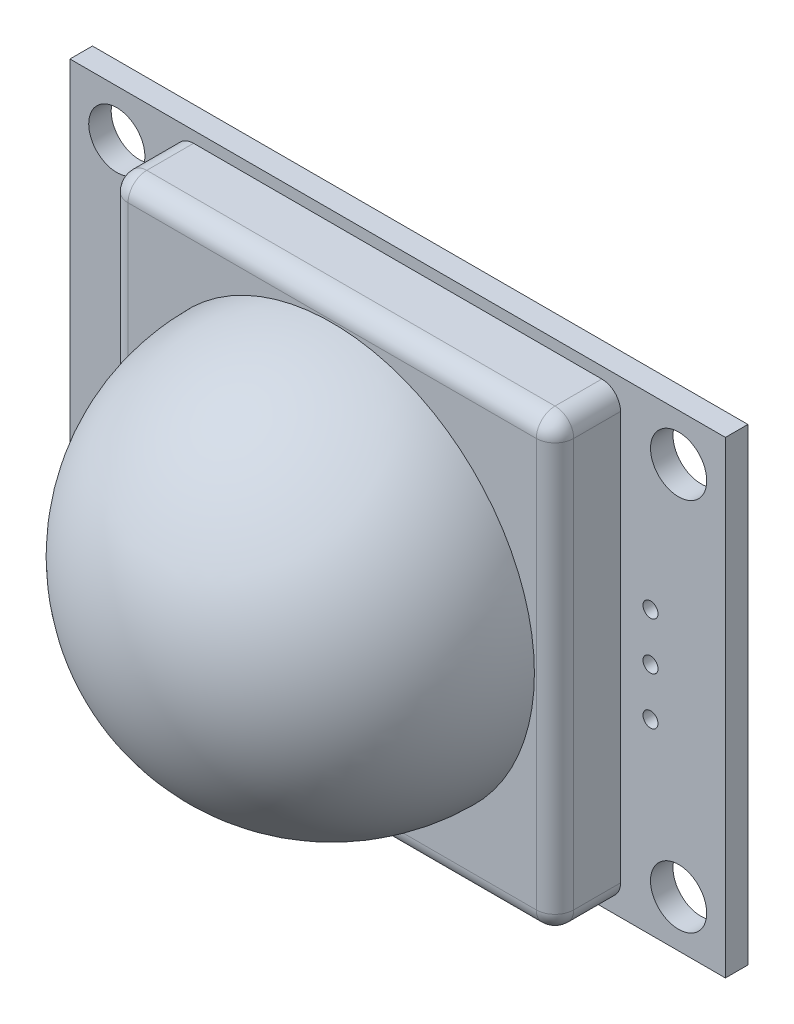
ISO-10303-21;
HEADER;
FILE_DESCRIPTION(('STEP AP214'),'2;1');
FILE_NAME('part.step','',(''),(''),'','','');
FILE_SCHEMA(('AUTOMOTIVE_DESIGN { 1 0 10303 214 1 1 1 1 }'));
ENDSEC;
DATA;
#1=APPLICATION_CONTEXT('core data for automotive mechanical design processes');
#2=APPLICATION_PROTOCOL_DEFINITION('international standard','automotive_design',2000,#1);
#3=PRODUCT_CONTEXT('',#1,'mechanical');
#4=PRODUCT('Part','Part','',(#3));
#5=PRODUCT_RELATED_PRODUCT_CATEGORY('part','',(#4));
#6=PRODUCT_DEFINITION_FORMATION('','',#4);
#7=PRODUCT_DEFINITION_CONTEXT('part definition',#1,'design');
#8=PRODUCT_DEFINITION('design','',#6,#7);
#9=PRODUCT_DEFINITION_SHAPE('','',#8);
#10=(LENGTH_UNIT() NAMED_UNIT(*) SI_UNIT(.MILLI.,.METRE.));
#11=(NAMED_UNIT(*) PLANE_ANGLE_UNIT() SI_UNIT($,.RADIAN.));
#12=(NAMED_UNIT(*) SI_UNIT($,.STERADIAN.) SOLID_ANGLE_UNIT());
#13=UNCERTAINTY_MEASURE_WITH_UNIT(LENGTH_MEASURE(1.E-05),#10,'distance_accuracy_value','');
#14=(GEOMETRIC_REPRESENTATION_CONTEXT(3) GLOBAL_UNCERTAINTY_ASSIGNED_CONTEXT((#13)) GLOBAL_UNIT_ASSIGNED_CONTEXT((#10,
#11,#12)) REPRESENTATION_CONTEXT('',''));
#15=CARTESIAN_POINT('',(0.,0.,0.));
#16=DIRECTION('',(0.,0.,1.));
#17=DIRECTION('',(1.,0.,0.));
#18=AXIS2_PLACEMENT_3D('',#15,#16,#17);
#19=CARTESIAN_POINT('',(28.4,23.4,4.7));
#20=DIRECTION('',(0.,0.,-1.));
#21=DIRECTION('',(-1.,0.,0.));
#22=AXIS2_PLACEMENT_3D('',#19,#20,#21);
#23=PLANE('',#22);
#24=DIRECTION('',(-1.,0.,0.));
#25=VECTOR('',#24,1.);
#26=CARTESIAN_POINT('',(28.4,23.4,4.7));
#27=LINE('',#26,#25);
#28=CARTESIAN_POINT('',(28.4,23.4,4.7));
#29=VERTEX_POINT('',#28);
#30=CARTESIAN_POINT('',(6.6,23.4,4.7));
#31=VERTEX_POINT('',#30);
#32=EDGE_CURVE('E256',#29,#31,#27,.T.);
#33=ORIENTED_EDGE('',*,*,#32,.T.);
#34=DIRECTION('',(0.,-1.,0.));
#35=VECTOR('',#34,1.);
#36=CARTESIAN_POINT('',(6.6,23.4,4.7));
#37=LINE('',#36,#35);
#38=CARTESIAN_POINT('',(6.6,1.6,4.7));
#39=VERTEX_POINT('',#38);
#40=EDGE_CURVE('E258',#31,#39,#37,.T.);
#41=ORIENTED_EDGE('',*,*,#40,.T.);
#42=DIRECTION('',(1.,0.,0.));
#43=VECTOR('',#42,1.);
#44=CARTESIAN_POINT('',(28.4,1.6,4.7));
#45=LINE('',#44,#43);
#46=CARTESIAN_POINT('',(28.4,1.6,4.7));
#47=VERTEX_POINT('',#46);
#48=EDGE_CURVE('E252',#39,#47,#45,.T.);
#49=ORIENTED_EDGE('',*,*,#48,.T.);
#50=DIRECTION('',(0.,1.,0.));
#51=VECTOR('',#50,1.);
#52=CARTESIAN_POINT('',(28.4,23.4,4.7));
#53=LINE('',#52,#51);
#54=EDGE_CURVE('E254',#47,#29,#53,.T.);
#55=ORIENTED_EDGE('',*,*,#54,.T.);
#56=EDGE_LOOP('',(#33,#41,#49,#55));
#57=FACE_BOUND('',#56,.T.);
#58=CARTESIAN_POINT('',(17.5,12.5,4.7));
#59=DIRECTION('',(0.,0.,-1.));
#60=DIRECTION('',(-1.,0.,0.));
#61=AXIS2_PLACEMENT_3D('',#58,#59,#60);
#62=CIRCLE('',#61,10.8001);
#63=CARTESIAN_POINT('',(6.6999,12.5,4.7));
#64=VERTEX_POINT('',#63);
#65=EDGE_CURVE('E11',#64,#64,#62,.F.);
#66=ORIENTED_EDGE('',*,*,#65,.F.);
#67=EDGE_LOOP('',(#66));
#68=FACE_BOUND('',#67,.T.);
#69=ADVANCED_FACE('F32',(#57,#68),#23,.F.);
#70=CARTESIAN_POINT('',(0.,25.,1.2));
#71=DIRECTION('',(0.,0.,-1.));
#72=DIRECTION('',(-1.,0.,0.));
#73=AXIS2_PLACEMENT_3D('',#70,#71,#72);
#74=PLANE('',#73);
#75=CARTESIAN_POINT('',(31.,15.04,1.2));
#76=DIRECTION('',(0.,0.,1.));
#77=DIRECTION('',(1.,0.,0.));
#78=AXIS2_PLACEMENT_3D('',#75,#76,#77);
#79=CIRCLE('',#78,0.400000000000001);
#80=CARTESIAN_POINT('',(31.4,15.04,1.2));
#81=VERTEX_POINT('',#80);
#82=EDGE_CURVE('E180',#81,#81,#79,.T.);
#83=ORIENTED_EDGE('',*,*,#82,.F.);
#84=EDGE_LOOP('',(#83));
#85=FACE_BOUND('',#84,.T.);
#86=CARTESIAN_POINT('',(31.,12.5,1.2));
#87=DIRECTION('',(0.,0.,1.));
#88=DIRECTION('',(1.,0.,0.));
#89=AXIS2_PLACEMENT_3D('',#86,#87,#88);
#90=CIRCLE('',#89,0.399999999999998);
#91=CARTESIAN_POINT('',(31.4,12.5,1.2));
#92=VERTEX_POINT('',#91);
#93=EDGE_CURVE('E192',#92,#92,#90,.T.);
#94=ORIENTED_EDGE('',*,*,#93,.F.);
#95=EDGE_LOOP('',(#94));
#96=FACE_BOUND('',#95,.T.);
#97=CARTESIAN_POINT('',(32.5,22.5,1.2));
#98=DIRECTION('',(0.,0.,1.));
#99=DIRECTION('',(1.,0.,0.));
#100=AXIS2_PLACEMENT_3D('',#97,#98,#99);
#101=CIRCLE('',#100,1.5);
#102=CARTESIAN_POINT('',(34.,22.5,1.2));
#103=VERTEX_POINT('',#102);
#104=EDGE_CURVE('E204',#103,#103,#101,.T.);
#105=ORIENTED_EDGE('',*,*,#104,.F.);
#106=EDGE_LOOP('',(#105));
#107=FACE_BOUND('',#106,.T.);
#108=CARTESIAN_POINT('',(2.5,2.5,1.2));
#109=DIRECTION('',(0.,0.,1.));
#110=DIRECTION('',(1.,0.,0.));
#111=AXIS2_PLACEMENT_3D('',#108,#109,#110);
#112=CIRCLE('',#111,1.5);
#113=CARTESIAN_POINT('',(4.,2.5,1.2));
#114=VERTEX_POINT('',#113);
#115=EDGE_CURVE('E216',#114,#114,#112,.T.);
#116=ORIENTED_EDGE('',*,*,#115,.F.);
#117=EDGE_LOOP('',(#116));
#118=FACE_BOUND('',#117,.T.);
#119=DIRECTION('',(0.,-1.,0.));
#120=VECTOR('',#119,1.);
#121=CARTESIAN_POINT('',(0.,0.,1.2));
#122=LINE('',#121,#120);
#123=CARTESIAN_POINT('',(0.,25.,1.2));
#124=VERTEX_POINT('',#123);
#125=CARTESIAN_POINT('',(0.,0.,1.2));
#126=VERTEX_POINT('',#125);
#127=EDGE_CURVE('E228',#124,#126,#122,.T.);
#128=ORIENTED_EDGE('',*,*,#127,.T.);
#129=DIRECTION('',(1.,0.,0.));
#130=VECTOR('',#129,1.);
#131=CARTESIAN_POINT('',(0.,0.,1.2));
#132=LINE('',#131,#130);
#133=CARTESIAN_POINT('',(35.,0.,1.2));
#134=VERTEX_POINT('',#133);
#135=EDGE_CURVE('E231',#126,#134,#132,.T.);
#136=ORIENTED_EDGE('',*,*,#135,.T.);
#137=DIRECTION('',(0.,1.,0.));
#138=VECTOR('',#137,1.);
#139=CARTESIAN_POINT('',(35.,0.,1.2));
#140=LINE('',#139,#138);
#141=CARTESIAN_POINT('',(35.,25.,1.2));
#142=VERTEX_POINT('',#141);
#143=EDGE_CURVE('E233',#134,#142,#140,.T.);
#144=ORIENTED_EDGE('',*,*,#143,.T.);
#145=DIRECTION('',(-1.,0.,0.));
#146=VECTOR('',#145,1.);
#147=CARTESIAN_POINT('',(0.,25.,1.2));
#148=LINE('',#147,#146);
#149=EDGE_CURVE('E235',#142,#124,#148,.T.);
#150=ORIENTED_EDGE('',*,*,#149,.T.);
#151=EDGE_LOOP('',(#128,#136,#144,#150));
#152=FACE_BOUND('',#151,.T.);
#153=CARTESIAN_POINT('',(32.5,2.50000000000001,1.2));
#154=DIRECTION('',(0.,0.,1.));
#155=DIRECTION('',(-1.,0.,0.));
#156=AXIS2_PLACEMENT_3D('',#153,#154,#155);
#157=CIRCLE('',#156,1.5);
#158=CARTESIAN_POINT('',(31.,2.50000000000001,1.2));
#159=VERTEX_POINT('',#158);
#160=EDGE_CURVE('E210',#159,#159,#157,.T.);
#161=ORIENTED_EDGE('',*,*,#160,.F.);
#162=EDGE_LOOP('',(#161));
#163=FACE_BOUND('',#162,.T.);
#164=CARTESIAN_POINT('',(2.5,22.5,1.2));
#165=DIRECTION('',(0.,0.,1.));
#166=DIRECTION('',(-1.,0.,0.));
#167=AXIS2_PLACEMENT_3D('',#164,#165,#166);
#168=CIRCLE('',#167,1.5);
#169=CARTESIAN_POINT('',(1.,22.5,1.2));
#170=VERTEX_POINT('',#169);
#171=EDGE_CURVE('E198',#170,#170,#168,.T.);
#172=ORIENTED_EDGE('',*,*,#171,.F.);
#173=EDGE_LOOP('',(#172));
#174=FACE_BOUND('',#173,.T.);
#175=CARTESIAN_POINT('',(31.,9.96,1.2));
#176=DIRECTION('',(0.,0.,1.));
#177=DIRECTION('',(-1.,0.,0.));
#178=AXIS2_PLACEMENT_3D('',#175,#176,#177);
#179=CIRCLE('',#178,0.400000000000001);
#180=CARTESIAN_POINT('',(30.6,9.96,1.2));
#181=VERTEX_POINT('',#180);
#182=EDGE_CURVE('E186',#181,#181,#179,.T.);
#183=ORIENTED_EDGE('',*,*,#182,.F.);
#184=EDGE_LOOP('',(#183));
#185=FACE_BOUND('',#184,.T.);
#186=CARTESIAN_POINT('',(28.4,23.4,1.2));
#187=DIRECTION('',(0.,0.,1.));
#188=DIRECTION('',(-1.,0.,0.));
#189=AXIS2_PLACEMENT_3D('',#186,#187,#188);
#190=CIRCLE('',#189,1.);
#191=CARTESIAN_POINT('',(29.4,23.4,1.2));
#192=VERTEX_POINT('',#191);
#193=CARTESIAN_POINT('',(28.4,24.4,1.2));
#194=VERTEX_POINT('',#193);
#195=EDGE_CURVE('E138',#192,#194,#190,.T.);
#196=ORIENTED_EDGE('',*,*,#195,.F.);
#197=DIRECTION('',(0.,1.,0.));
#198=VECTOR('',#197,1.);
#199=CARTESIAN_POINT('',(29.4,23.4,1.2));
#200=LINE('',#199,#198);
#201=CARTESIAN_POINT('',(29.4,1.60000000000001,1.2));
#202=VERTEX_POINT('',#201);
#203=EDGE_CURVE('E144',#202,#192,#200,.T.);
#204=ORIENTED_EDGE('',*,*,#203,.F.);
#205=CARTESIAN_POINT('',(28.4,1.6,1.2));
#206=DIRECTION('',(0.,0.,1.));
#207=DIRECTION('',(1.,0.,0.));
#208=AXIS2_PLACEMENT_3D('',#205,#206,#207);
#209=CIRCLE('',#208,1.);
#210=CARTESIAN_POINT('',(28.4,0.600000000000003,1.2));
#211=VERTEX_POINT('',#210);
#212=EDGE_CURVE('E158',#211,#202,#209,.T.);
#213=ORIENTED_EDGE('',*,*,#212,.F.);
#214=DIRECTION('',(1.,0.,0.));
#215=VECTOR('',#214,1.);
#216=CARTESIAN_POINT('',(6.60000000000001,0.599999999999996,1.2));
#217=LINE('',#216,#215);
#218=CARTESIAN_POINT('',(6.60000000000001,0.599999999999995,1.2));
#219=VERTEX_POINT('',#218);
#220=EDGE_CURVE('E160',#219,#211,#217,.T.);
#221=ORIENTED_EDGE('',*,*,#220,.F.);
#222=CARTESIAN_POINT('',(6.6,1.6,1.2));
#223=DIRECTION('',(0.,0.,1.));
#224=DIRECTION('',(1.,0.,0.));
#225=AXIS2_PLACEMENT_3D('',#222,#223,#224);
#226=CIRCLE('',#225,1.);
#227=CARTESIAN_POINT('',(5.6,1.6,1.2));
#228=VERTEX_POINT('',#227);
#229=EDGE_CURVE('E285',#228,#219,#226,.T.);
#230=ORIENTED_EDGE('',*,*,#229,.F.);
#231=DIRECTION('',(0.,-1.,0.));
#232=VECTOR('',#231,1.);
#233=CARTESIAN_POINT('',(5.6,23.4,1.2));
#234=LINE('',#233,#232);
#235=CARTESIAN_POINT('',(5.6,23.4,1.2));
#236=VERTEX_POINT('',#235);
#237=EDGE_CURVE('E320',#236,#228,#234,.T.);
#238=ORIENTED_EDGE('',*,*,#237,.F.);
#239=CARTESIAN_POINT('',(6.6,23.4,1.2));
#240=DIRECTION('',(0.,0.,1.));
#241=DIRECTION('',(1.,0.,0.));
#242=AXIS2_PLACEMENT_3D('',#239,#240,#241);
#243=CIRCLE('',#242,1.);
#244=CARTESIAN_POINT('',(6.6,24.4,1.2));
#245=VERTEX_POINT('',#244);
#246=EDGE_CURVE('E317',#245,#236,#243,.T.);
#247=ORIENTED_EDGE('',*,*,#246,.F.);
#248=DIRECTION('',(-1.,0.,0.));
#249=VECTOR('',#248,1.);
#250=CARTESIAN_POINT('',(6.6,24.4,1.2));
#251=LINE('',#250,#249);
#252=EDGE_CURVE('E154',#194,#245,#251,.T.);
#253=ORIENTED_EDGE('',*,*,#252,.F.);
#254=EDGE_LOOP('',(#196,#204,#213,#221,#230,#238,#247,#253));
#255=FACE_BOUND('',#254,.T.);
#256=ADVANCED_FACE('F149',(#85,#96,#107,#118,#152,#163,#174,#185,#255),#74,.F.);
#257=CARTESIAN_POINT('',(0.,25.,0.));
#258=DIRECTION('',(0.,0.,-1.));
#259=DIRECTION('',(-1.,0.,0.));
#260=AXIS2_PLACEMENT_3D('',#257,#258,#259);
#261=PLANE('',#260);
#262=CARTESIAN_POINT('',(31.,9.96,0.));
#263=DIRECTION('',(0.,0.,1.));
#264=DIRECTION('',(-1.,0.,0.));
#265=AXIS2_PLACEMENT_3D('',#262,#263,#264);
#266=CIRCLE('',#265,0.400000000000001);
#267=CARTESIAN_POINT('',(30.6,9.96,0.));
#268=VERTEX_POINT('',#267);
#269=EDGE_CURVE('E183',#268,#268,#266,.T.);
#270=ORIENTED_EDGE('',*,*,#269,.T.);
#271=EDGE_LOOP('',(#270));
#272=FACE_BOUND('',#271,.T.);
#273=CARTESIAN_POINT('',(2.5,22.5,0.));
#274=DIRECTION('',(0.,0.,1.));
#275=DIRECTION('',(-1.,0.,0.));
#276=AXIS2_PLACEMENT_3D('',#273,#274,#275);
#277=CIRCLE('',#276,1.5);
#278=CARTESIAN_POINT('',(1.,22.5,0.));
#279=VERTEX_POINT('',#278);
#280=EDGE_CURVE('E195',#279,#279,#277,.T.);
#281=ORIENTED_EDGE('',*,*,#280,.T.);
#282=EDGE_LOOP('',(#281));
#283=FACE_BOUND('',#282,.T.);
#284=CARTESIAN_POINT('',(32.5,2.50000000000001,0.));
#285=DIRECTION('',(0.,0.,1.));
#286=DIRECTION('',(-1.,0.,0.));
#287=AXIS2_PLACEMENT_3D('',#284,#285,#286);
#288=CIRCLE('',#287,1.5);
#289=CARTESIAN_POINT('',(31.,2.50000000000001,0.));
#290=VERTEX_POINT('',#289);
#291=EDGE_CURVE('E207',#290,#290,#288,.T.);
#292=ORIENTED_EDGE('',*,*,#291,.T.);
#293=EDGE_LOOP('',(#292));
#294=FACE_BOUND('',#293,.T.);
#295=DIRECTION('',(0.,-1.,0.));
#296=VECTOR('',#295,1.);
#297=CARTESIAN_POINT('',(0.,0.,0.));
#298=LINE('',#297,#296);
#299=CARTESIAN_POINT('',(0.,25.,0.));
#300=VERTEX_POINT('',#299);
#301=CARTESIAN_POINT('',(0.,0.,0.));
#302=VERTEX_POINT('',#301);
#303=EDGE_CURVE('E219',#300,#302,#298,.T.);
#304=ORIENTED_EDGE('',*,*,#303,.F.);
#305=DIRECTION('',(-1.,0.,0.));
#306=VECTOR('',#305,1.);
#307=CARTESIAN_POINT('',(0.,25.,0.));
#308=LINE('',#307,#306);
#309=CARTESIAN_POINT('',(35.,25.,0.));
#310=VERTEX_POINT('',#309);
#311=EDGE_CURVE('E226',#310,#300,#308,.T.);
#312=ORIENTED_EDGE('',*,*,#311,.F.);
#313=DIRECTION('',(0.,1.,0.));
#314=VECTOR('',#313,1.);
#315=CARTESIAN_POINT('',(35.,0.,0.));
#316=LINE('',#315,#314);
#317=CARTESIAN_POINT('',(35.,0.,0.));
#318=VERTEX_POINT('',#317);
#319=EDGE_CURVE('E224',#318,#310,#316,.T.);
#320=ORIENTED_EDGE('',*,*,#319,.F.);
#321=DIRECTION('',(1.,0.,0.));
#322=VECTOR('',#321,1.);
#323=CARTESIAN_POINT('',(0.,0.,0.));
#324=LINE('',#323,#322);
#325=EDGE_CURVE('E222',#302,#318,#324,.T.);
#326=ORIENTED_EDGE('',*,*,#325,.F.);
#327=EDGE_LOOP('',(#304,#312,#320,#326));
#328=FACE_BOUND('',#327,.T.);
#329=CARTESIAN_POINT('',(2.5,2.5,0.));
#330=DIRECTION('',(0.,0.,1.));
#331=DIRECTION('',(1.,0.,0.));
#332=AXIS2_PLACEMENT_3D('',#329,#330,#331);
#333=CIRCLE('',#332,1.5);
#334=CARTESIAN_POINT('',(4.,2.5,0.));
#335=VERTEX_POINT('',#334);
#336=EDGE_CURVE('E213',#335,#335,#333,.T.);
#337=ORIENTED_EDGE('',*,*,#336,.T.);
#338=EDGE_LOOP('',(#337));
#339=FACE_BOUND('',#338,.T.);
#340=CARTESIAN_POINT('',(32.5,22.5,0.));
#341=DIRECTION('',(0.,0.,1.));
#342=DIRECTION('',(1.,0.,0.));
#343=AXIS2_PLACEMENT_3D('',#340,#341,#342);
#344=CIRCLE('',#343,1.5);
#345=CARTESIAN_POINT('',(34.,22.5,0.));
#346=VERTEX_POINT('',#345);
#347=EDGE_CURVE('E201',#346,#346,#344,.T.);
#348=ORIENTED_EDGE('',*,*,#347,.T.);
#349=EDGE_LOOP('',(#348));
#350=FACE_BOUND('',#349,.T.);
#351=CARTESIAN_POINT('',(31.,12.5,0.));
#352=DIRECTION('',(0.,0.,1.));
#353=DIRECTION('',(1.,0.,0.));
#354=AXIS2_PLACEMENT_3D('',#351,#352,#353);
#355=CIRCLE('',#354,0.399999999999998);
#356=CARTESIAN_POINT('',(31.4,12.5,0.));
#357=VERTEX_POINT('',#356);
#358=EDGE_CURVE('E189',#357,#357,#355,.T.);
#359=ORIENTED_EDGE('',*,*,#358,.T.);
#360=EDGE_LOOP('',(#359));
#361=FACE_BOUND('',#360,.T.);
#362=CARTESIAN_POINT('',(31.,15.04,0.));
#363=DIRECTION('',(0.,0.,1.));
#364=DIRECTION('',(1.,0.,0.));
#365=AXIS2_PLACEMENT_3D('',#362,#363,#364);
#366=CIRCLE('',#365,0.400000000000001);
#367=CARTESIAN_POINT('',(31.4,15.04,0.));
#368=VERTEX_POINT('',#367);
#369=EDGE_CURVE('E177',#368,#368,#366,.T.);
#370=ORIENTED_EDGE('',*,*,#369,.T.);
#371=EDGE_LOOP('',(#370));
#372=FACE_BOUND('',#371,.T.);
#373=ADVANCED_FACE('F352',(#272,#283,#294,#328,#339,#350,#361,#372),#261,.T.);
#374=CARTESIAN_POINT('',(0.,0.,1.2));
#375=DIRECTION('',(1.,0.,0.));
#376=DIRECTION('',(0.,0.,-1.));
#377=AXIS2_PLACEMENT_3D('',#374,#375,#376);
#378=PLANE('',#377);
#379=ORIENTED_EDGE('',*,*,#303,.T.);
#380=DIRECTION('',(0.,0.,-1.));
#381=VECTOR('',#380,1.);
#382=CARTESIAN_POINT('',(0.,0.,1.2));
#383=LINE('',#382,#381);
#384=EDGE_CURVE('E246',#126,#302,#383,.T.);
#385=ORIENTED_EDGE('',*,*,#384,.F.);
#386=ORIENTED_EDGE('',*,*,#127,.F.);
#387=DIRECTION('',(0.,0.,-1.));
#388=VECTOR('',#387,1.);
#389=CARTESIAN_POINT('',(0.,25.,1.2));
#390=LINE('',#389,#388);
#391=EDGE_CURVE('E237',#124,#300,#390,.T.);
#392=ORIENTED_EDGE('',*,*,#391,.T.);
#393=EDGE_LOOP('',(#379,#385,#386,#392));
#394=FACE_BOUND('',#393,.T.);
#395=ADVANCED_FACE('F34',(#394),#378,.F.);
#396=CARTESIAN_POINT('',(0.,0.,1.2));
#397=DIRECTION('',(0.,1.,0.));
#398=DIRECTION('',(0.,0.,1.));
#399=AXIS2_PLACEMENT_3D('',#396,#397,#398);
#400=PLANE('',#399);
#401=ORIENTED_EDGE('',*,*,#325,.T.);
#402=DIRECTION('',(0.,0.,-1.));
#403=VECTOR('',#402,1.);
#404=CARTESIAN_POINT('',(35.,0.,1.2));
#405=LINE('',#404,#403);
#406=EDGE_CURVE('E243',#134,#318,#405,.T.);
#407=ORIENTED_EDGE('',*,*,#406,.F.);
#408=ORIENTED_EDGE('',*,*,#135,.F.);
#409=ORIENTED_EDGE('',*,*,#384,.T.);
#410=EDGE_LOOP('',(#401,#407,#408,#409));
#411=FACE_BOUND('',#410,.T.);
#412=ADVANCED_FACE('F552',(#411),#400,.F.);
#413=CARTESIAN_POINT('',(35.,0.,1.2));
#414=DIRECTION('',(-1.,0.,0.));
#415=DIRECTION('',(0.,0.,1.));
#416=AXIS2_PLACEMENT_3D('',#413,#414,#415);
#417=PLANE('',#416);
#418=ORIENTED_EDGE('',*,*,#319,.T.);
#419=DIRECTION('',(0.,0.,-1.));
#420=VECTOR('',#419,1.);
#421=CARTESIAN_POINT('',(35.,25.,1.2));
#422=LINE('',#421,#420);
#423=EDGE_CURVE('E240',#142,#310,#422,.T.);
#424=ORIENTED_EDGE('',*,*,#423,.F.);
#425=ORIENTED_EDGE('',*,*,#143,.F.);
#426=ORIENTED_EDGE('',*,*,#406,.T.);
#427=EDGE_LOOP('',(#418,#424,#425,#426));
#428=FACE_BOUND('',#427,.T.);
#429=ADVANCED_FACE('F544',(#428),#417,.F.);
#430=CARTESIAN_POINT('',(0.,25.,1.2));
#431=DIRECTION('',(0.,-1.,0.));
#432=DIRECTION('',(0.,0.,-1.));
#433=AXIS2_PLACEMENT_3D('',#430,#431,#432);
#434=PLANE('',#433);
#435=ORIENTED_EDGE('',*,*,#311,.T.);
#436=ORIENTED_EDGE('',*,*,#391,.F.);
#437=ORIENTED_EDGE('',*,*,#149,.F.);
#438=ORIENTED_EDGE('',*,*,#423,.T.);
#439=EDGE_LOOP('',(#435,#436,#437,#438));
#440=FACE_BOUND('',#439,.T.);
#441=ADVANCED_FACE('F536',(#440),#434,.F.);
#442=CARTESIAN_POINT('',(2.5,2.5,1.2));
#443=DIRECTION('',(0.,0.,-1.));
#444=DIRECTION('',(-1.,0.,0.));
#445=AXIS2_PLACEMENT_3D('',#442,#443,#444);
#446=CYLINDRICAL_SURFACE('',#445,1.5);
#447=ORIENTED_EDGE('',*,*,#115,.T.);
#448=EDGE_LOOP('',(#447));
#449=FACE_BOUND('',#448,.T.);
#450=ORIENTED_EDGE('',*,*,#336,.F.);
#451=EDGE_LOOP('',(#450));
#452=FACE_BOUND('',#451,.T.);
#453=ADVANCED_FACE('F528',(#449,#452),#446,.F.);
#454=CARTESIAN_POINT('',(32.5,2.50000000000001,1.2));
#455=DIRECTION('',(0.,0.,-1.));
#456=DIRECTION('',(-1.,0.,0.));
#457=AXIS2_PLACEMENT_3D('',#454,#455,#456);
#458=CYLINDRICAL_SURFACE('',#457,1.5);
#459=ORIENTED_EDGE('',*,*,#160,.T.);
#460=EDGE_LOOP('',(#459));
#461=FACE_BOUND('',#460,.T.);
#462=ORIENTED_EDGE('',*,*,#291,.F.);
#463=EDGE_LOOP('',(#462));
#464=FACE_BOUND('',#463,.T.);
#465=ADVANCED_FACE('F520',(#461,#464),#458,.F.);
#466=CARTESIAN_POINT('',(32.5,22.5,1.2));
#467=DIRECTION('',(0.,0.,-1.));
#468=DIRECTION('',(-1.,0.,0.));
#469=AXIS2_PLACEMENT_3D('',#466,#467,#468);
#470=CYLINDRICAL_SURFACE('',#469,1.5);
#471=ORIENTED_EDGE('',*,*,#104,.T.);
#472=EDGE_LOOP('',(#471));
#473=FACE_BOUND('',#472,.T.);
#474=ORIENTED_EDGE('',*,*,#347,.F.);
#475=EDGE_LOOP('',(#474));
#476=FACE_BOUND('',#475,.T.);
#477=ADVANCED_FACE('F512',(#473,#476),#470,.F.);
#478=CARTESIAN_POINT('',(2.5,22.5,1.2));
#479=DIRECTION('',(0.,0.,-1.));
#480=DIRECTION('',(-1.,0.,0.));
#481=AXIS2_PLACEMENT_3D('',#478,#479,#480);
#482=CYLINDRICAL_SURFACE('',#481,1.5);
#483=ORIENTED_EDGE('',*,*,#171,.T.);
#484=EDGE_LOOP('',(#483));
#485=FACE_BOUND('',#484,.T.);
#486=ORIENTED_EDGE('',*,*,#280,.F.);
#487=EDGE_LOOP('',(#486));
#488=FACE_BOUND('',#487,.T.);
#489=ADVANCED_FACE('F504',(#485,#488),#482,.F.);
#490=CARTESIAN_POINT('',(31.,12.5,1.2));
#491=DIRECTION('',(0.,0.,-1.));
#492=DIRECTION('',(-1.,0.,0.));
#493=AXIS2_PLACEMENT_3D('',#490,#491,#492);
#494=CYLINDRICAL_SURFACE('',#493,0.399999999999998);
#495=ORIENTED_EDGE('',*,*,#93,.T.);
#496=EDGE_LOOP('',(#495));
#497=FACE_BOUND('',#496,.T.);
#498=ORIENTED_EDGE('',*,*,#358,.F.);
#499=EDGE_LOOP('',(#498));
#500=FACE_BOUND('',#499,.T.);
#501=ADVANCED_FACE('F496',(#497,#500),#494,.F.);
#502=CARTESIAN_POINT('',(31.,9.96,1.2));
#503=DIRECTION('',(0.,0.,-1.));
#504=DIRECTION('',(-1.,0.,0.));
#505=AXIS2_PLACEMENT_3D('',#502,#503,#504);
#506=CYLINDRICAL_SURFACE('',#505,0.400000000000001);
#507=ORIENTED_EDGE('',*,*,#182,.T.);
#508=EDGE_LOOP('',(#507));
#509=FACE_BOUND('',#508,.T.);
#510=ORIENTED_EDGE('',*,*,#269,.F.);
#511=EDGE_LOOP('',(#510));
#512=FACE_BOUND('',#511,.T.);
#513=ADVANCED_FACE('F488',(#509,#512),#506,.F.);
#514=CARTESIAN_POINT('',(31.,15.04,1.2));
#515=DIRECTION('',(0.,0.,-1.));
#516=DIRECTION('',(-1.,0.,0.));
#517=AXIS2_PLACEMENT_3D('',#514,#515,#516);
#518=CYLINDRICAL_SURFACE('',#517,0.400000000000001);
#519=ORIENTED_EDGE('',*,*,#82,.T.);
#520=EDGE_LOOP('',(#519));
#521=FACE_BOUND('',#520,.T.);
#522=ORIENTED_EDGE('',*,*,#369,.F.);
#523=EDGE_LOOP('',(#522));
#524=FACE_BOUND('',#523,.T.);
#525=ADVANCED_FACE('F477',(#521,#524),#518,.F.);
#526=CARTESIAN_POINT('',(28.4,23.4,4.7));
#527=DIRECTION('',(0.,0.,-1.));
#528=DIRECTION('',(-1.,0.,0.));
#529=AXIS2_PLACEMENT_3D('',#526,#527,#528);
#530=CYLINDRICAL_SURFACE('',#529,1.);
#531=DIRECTION('',(0.,0.,-1.));
#532=VECTOR('',#531,1.);
#533=CARTESIAN_POINT('',(28.4,24.4,4.7));
#534=LINE('',#533,#532);
#535=CARTESIAN_POINT('',(28.4,24.4,3.7));
#536=VERTEX_POINT('',#535);
#537=EDGE_CURVE('E175',#536,#194,#534,.T.);
#538=ORIENTED_EDGE('',*,*,#537,.F.);
#539=CARTESIAN_POINT('',(28.4,23.4,3.7));
#540=DIRECTION('',(0.,0.,-1.));
#541=DIRECTION('',(-1.,0.,0.));
#542=AXIS2_PLACEMENT_3D('',#539,#540,#541);
#543=CIRCLE('',#542,1.);
#544=CARTESIAN_POINT('',(29.4,23.4,3.7));
#545=VERTEX_POINT('',#544);
#546=EDGE_CURVE('E140',#536,#545,#543,.T.);
#547=ORIENTED_EDGE('',*,*,#546,.T.);
#548=DIRECTION('',(0.,0.,-1.));
#549=VECTOR('',#548,1.);
#550=CARTESIAN_POINT('',(29.4,23.4,4.7));
#551=LINE('',#550,#549);
#552=EDGE_CURVE('E134',#545,#192,#551,.T.);
#553=ORIENTED_EDGE('',*,*,#552,.T.);
#554=ORIENTED_EDGE('',*,*,#195,.T.);
#555=EDGE_LOOP('',(#538,#547,#553,#554));
#556=FACE_BOUND('',#555,.T.);
#557=ADVANCED_FACE('F137',(#556),#530,.T.);
#558=CARTESIAN_POINT('',(6.6,24.4,4.7));
#559=DIRECTION('',(0.,-1.,0.));
#560=DIRECTION('',(1.,0.,0.));
#561=AXIS2_PLACEMENT_3D('',#558,#559,#560);
#562=PLANE('',#561);
#563=DIRECTION('',(0.,0.,-1.));
#564=VECTOR('',#563,1.);
#565=CARTESIAN_POINT('',(6.6,24.4,4.7));
#566=LINE('',#565,#564);
#567=CARTESIAN_POINT('',(6.6,24.4,3.7));
#568=VERTEX_POINT('',#567);
#569=EDGE_CURVE('E173',#568,#245,#566,.T.);
#570=ORIENTED_EDGE('',*,*,#569,.F.);
#571=DIRECTION('',(-1.,0.,0.));
#572=VECTOR('',#571,1.);
#573=CARTESIAN_POINT('',(6.6,24.4,3.7));
#574=LINE('',#573,#572);
#575=EDGE_CURVE('E265',#568,#536,#574,.F.);
#576=ORIENTED_EDGE('',*,*,#575,.T.);
#577=ORIENTED_EDGE('',*,*,#537,.T.);
#578=ORIENTED_EDGE('',*,*,#252,.T.);
#579=EDGE_LOOP('',(#570,#576,#577,#578));
#580=FACE_BOUND('',#579,.T.);
#581=ADVANCED_FACE('F462',(#580),#562,.F.);
#582=CARTESIAN_POINT('',(6.6,23.4,4.7));
#583=DIRECTION('',(0.,0.,-1.));
#584=DIRECTION('',(-1.,0.,0.));
#585=AXIS2_PLACEMENT_3D('',#582,#583,#584);
#586=CYLINDRICAL_SURFACE('',#585,1.);
#587=DIRECTION('',(0.,0.,-1.));
#588=VECTOR('',#587,1.);
#589=CARTESIAN_POINT('',(5.6,23.4,4.7));
#590=LINE('',#589,#588);
#591=CARTESIAN_POINT('',(5.6,23.4,3.7));
#592=VERTEX_POINT('',#591);
#593=EDGE_CURVE('E171',#592,#236,#590,.T.);
#594=ORIENTED_EDGE('',*,*,#593,.F.);
#595=CARTESIAN_POINT('',(6.6,23.4,3.7));
#596=DIRECTION('',(0.,0.,-1.));
#597=DIRECTION('',(-1.,0.,0.));
#598=AXIS2_PLACEMENT_3D('',#595,#596,#597);
#599=CIRCLE('',#598,1.);
#600=EDGE_CURVE('E263',#592,#568,#599,.T.);
#601=ORIENTED_EDGE('',*,*,#600,.T.);
#602=ORIENTED_EDGE('',*,*,#569,.T.);
#603=ORIENTED_EDGE('',*,*,#246,.T.);
#604=EDGE_LOOP('',(#594,#601,#602,#603));
#605=FACE_BOUND('',#604,.T.);
#606=ADVANCED_FACE('F454',(#605),#586,.T.);
#607=CARTESIAN_POINT('',(5.6,23.4,4.7));
#608=DIRECTION('',(1.,0.,0.));
#609=DIRECTION('',(0.,1.,0.));
#610=AXIS2_PLACEMENT_3D('',#607,#608,#609);
#611=PLANE('',#610);
#612=DIRECTION('',(0.,0.,-1.));
#613=VECTOR('',#612,1.);
#614=CARTESIAN_POINT('',(5.6,1.6,4.7));
#615=LINE('',#614,#613);
#616=CARTESIAN_POINT('',(5.6,1.6,3.7));
#617=VERTEX_POINT('',#616);
#618=EDGE_CURVE('E169',#617,#228,#615,.T.);
#619=ORIENTED_EDGE('',*,*,#618,.F.);
#620=DIRECTION('',(0.,-1.,0.));
#621=VECTOR('',#620,1.);
#622=CARTESIAN_POINT('',(5.6,23.4,3.7));
#623=LINE('',#622,#621);
#624=EDGE_CURVE('E261',#617,#592,#623,.F.);
#625=ORIENTED_EDGE('',*,*,#624,.T.);
#626=ORIENTED_EDGE('',*,*,#593,.T.);
#627=ORIENTED_EDGE('',*,*,#237,.T.);
#628=EDGE_LOOP('',(#619,#625,#626,#627));
#629=FACE_BOUND('',#628,.T.);
#630=ADVANCED_FACE('F447',(#629),#611,.F.);
#631=CARTESIAN_POINT('',(6.6,1.6,4.7));
#632=DIRECTION('',(0.,0.,-1.));
#633=DIRECTION('',(-1.,0.,0.));
#634=AXIS2_PLACEMENT_3D('',#631,#632,#633);
#635=CYLINDRICAL_SURFACE('',#634,1.);
#636=DIRECTION('',(0.,0.,-1.));
#637=VECTOR('',#636,1.);
#638=CARTESIAN_POINT('',(6.60000000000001,0.599999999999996,4.7));
#639=LINE('',#638,#637);
#640=CARTESIAN_POINT('',(6.60000000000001,0.599999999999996,3.7));
#641=VERTEX_POINT('',#640);
#642=EDGE_CURVE('E167',#641,#219,#639,.T.);
#643=ORIENTED_EDGE('',*,*,#642,.F.);
#644=CARTESIAN_POINT('',(6.6,1.6,3.7));
#645=DIRECTION('',(0.,0.,-1.));
#646=DIRECTION('',(-1.,0.,0.));
#647=AXIS2_PLACEMENT_3D('',#644,#645,#646);
#648=CIRCLE('',#647,1.);
#649=EDGE_CURVE('E249',#641,#617,#648,.T.);
#650=ORIENTED_EDGE('',*,*,#649,.T.);
#651=ORIENTED_EDGE('',*,*,#618,.T.);
#652=ORIENTED_EDGE('',*,*,#229,.T.);
#653=EDGE_LOOP('',(#643,#650,#651,#652));
#654=FACE_BOUND('',#653,.T.);
#655=ADVANCED_FACE('F282',(#654),#635,.T.);
#656=CARTESIAN_POINT('',(6.60000000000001,0.599999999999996,4.7));
#657=DIRECTION('',(0.,1.,0.));
#658=DIRECTION('',(-1.,0.,0.));
#659=AXIS2_PLACEMENT_3D('',#656,#657,#658);
#660=PLANE('',#659);
#661=DIRECTION('',(0.,0.,-1.));
#662=VECTOR('',#661,1.);
#663=CARTESIAN_POINT('',(28.4,0.600000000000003,4.7));
#664=LINE('',#663,#662);
#665=CARTESIAN_POINT('',(28.4,0.600000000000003,3.7));
#666=VERTEX_POINT('',#665);
#667=EDGE_CURVE('E165',#666,#211,#664,.T.);
#668=ORIENTED_EDGE('',*,*,#667,.F.);
#669=DIRECTION('',(1.,0.,0.));
#670=VECTOR('',#669,1.);
#671=CARTESIAN_POINT('',(6.60000000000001,0.599999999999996,3.7));
#672=LINE('',#671,#670);
#673=EDGE_CURVE('E41',#666,#641,#672,.F.);
#674=ORIENTED_EDGE('',*,*,#673,.T.);
#675=ORIENTED_EDGE('',*,*,#642,.T.);
#676=ORIENTED_EDGE('',*,*,#220,.T.);
#677=EDGE_LOOP('',(#668,#674,#675,#676));
#678=FACE_BOUND('',#677,.T.);
#679=ADVANCED_FACE('F272',(#678),#660,.F.);
#680=CARTESIAN_POINT('',(28.4,1.6,4.7));
#681=DIRECTION('',(0.,0.,-1.));
#682=DIRECTION('',(-1.,0.,0.));
#683=AXIS2_PLACEMENT_3D('',#680,#681,#682);
#684=CYLINDRICAL_SURFACE('',#683,1.);
#685=DIRECTION('',(0.,0.,-1.));
#686=VECTOR('',#685,1.);
#687=CARTESIAN_POINT('',(29.4,1.60000000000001,4.7));
#688=LINE('',#687,#686);
#689=CARTESIAN_POINT('',(29.4,1.60000000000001,3.7));
#690=VERTEX_POINT('',#689);
#691=EDGE_CURVE('E143',#690,#202,#688,.T.);
#692=ORIENTED_EDGE('',*,*,#691,.F.);
#693=CARTESIAN_POINT('',(28.4,1.6,3.7));
#694=DIRECTION('',(0.,0.,-1.));
#695=DIRECTION('',(-1.,0.,0.));
#696=AXIS2_PLACEMENT_3D('',#693,#694,#695);
#697=CIRCLE('',#696,1.);
#698=EDGE_CURVE('E48',#690,#666,#697,.T.);
#699=ORIENTED_EDGE('',*,*,#698,.T.);
#700=ORIENTED_EDGE('',*,*,#667,.T.);
#701=ORIENTED_EDGE('',*,*,#212,.T.);
#702=EDGE_LOOP('',(#692,#699,#700,#701));
#703=FACE_BOUND('',#702,.T.);
#704=ADVANCED_FACE('F324',(#703),#684,.T.);
#705=CARTESIAN_POINT('',(29.4,23.4,4.7));
#706=DIRECTION('',(-1.,0.,0.));
#707=DIRECTION('',(0.,0.,1.));
#708=AXIS2_PLACEMENT_3D('',#705,#706,#707);
#709=PLANE('',#708);
#710=ORIENTED_EDGE('',*,*,#552,.F.);
#711=DIRECTION('',(0.,1.,0.));
#712=VECTOR('',#711,1.);
#713=CARTESIAN_POINT('',(29.4,23.4,3.7));
#714=LINE('',#713,#712);
#715=EDGE_CURVE('E56',#545,#690,#714,.F.);
#716=ORIENTED_EDGE('',*,*,#715,.T.);
#717=ORIENTED_EDGE('',*,*,#691,.T.);
#718=ORIENTED_EDGE('',*,*,#203,.T.);
#719=EDGE_LOOP('',(#710,#716,#717,#718));
#720=FACE_BOUND('',#719,.T.);
#721=ADVANCED_FACE('F157',(#720),#709,.F.);
#722=CARTESIAN_POINT('',(28.4,23.4,3.7));
#723=DIRECTION('',(0.,0.,1.));
#724=DIRECTION('',(1.,0.,0.));
#725=AXIS2_PLACEMENT_3D('',#722,#723,#724);
#726=SPHERICAL_SURFACE('',#725,1.);
#727=CARTESIAN_POINT('',(28.4,23.4,3.7));
#728=DIRECTION('',(0.,-1.,0.));
#729=DIRECTION('',(1.,0.,0.));
#730=AXIS2_PLACEMENT_3D('',#727,#728,#729);
#731=CIRCLE('',#730,1.);
#732=EDGE_CURVE('E311',#545,#29,#731,.T.);
#733=ORIENTED_EDGE('',*,*,#732,.F.);
#734=ORIENTED_EDGE('',*,*,#546,.F.);
#735=CARTESIAN_POINT('',(28.4,23.4,3.7));
#736=DIRECTION('',(-1.,0.,0.));
#737=DIRECTION('',(0.,-1.,0.));
#738=AXIS2_PLACEMENT_3D('',#735,#736,#737);
#739=CIRCLE('',#738,1.);
#740=EDGE_CURVE('E155',#29,#536,#739,.T.);
#741=ORIENTED_EDGE('',*,*,#740,.F.);
#742=EDGE_LOOP('',(#733,#734,#741));
#743=FACE_BOUND('',#742,.T.);
#744=ADVANCED_FACE('F414',(#743),#726,.T.);
#745=CARTESIAN_POINT('',(28.4,23.4,3.7));
#746=DIRECTION('',(-1.,0.,0.));
#747=DIRECTION('',(0.,-1.,0.));
#748=AXIS2_PLACEMENT_3D('',#745,#746,#747);
#749=CYLINDRICAL_SURFACE('',#748,1.);
#750=ORIENTED_EDGE('',*,*,#740,.T.);
#751=ORIENTED_EDGE('',*,*,#575,.F.);
#752=CARTESIAN_POINT('',(6.6,23.4,3.7));
#753=DIRECTION('',(-1.,0.,0.));
#754=DIRECTION('',(0.,-1.,0.));
#755=AXIS2_PLACEMENT_3D('',#752,#753,#754);
#756=CIRCLE('',#755,1.);
#757=EDGE_CURVE('E308',#31,#568,#756,.T.);
#758=ORIENTED_EDGE('',*,*,#757,.F.);
#759=ORIENTED_EDGE('',*,*,#32,.F.);
#760=EDGE_LOOP('',(#750,#751,#758,#759));
#761=FACE_BOUND('',#760,.T.);
#762=ADVANCED_FACE('F407',(#761),#749,.T.);
#763=CARTESIAN_POINT('',(28.4,23.4,3.7));
#764=DIRECTION('',(0.,1.,0.));
#765=DIRECTION('',(0.,0.,1.));
#766=AXIS2_PLACEMENT_3D('',#763,#764,#765);
#767=CYLINDRICAL_SURFACE('',#766,1.);
#768=ORIENTED_EDGE('',*,*,#732,.T.);
#769=ORIENTED_EDGE('',*,*,#54,.F.);
#770=CARTESIAN_POINT('',(28.4,1.60000000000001,3.7));
#771=DIRECTION('',(0.,-1.,0.));
#772=DIRECTION('',(0.,0.,-1.));
#773=AXIS2_PLACEMENT_3D('',#770,#771,#772);
#774=CIRCLE('',#773,1.);
#775=EDGE_CURVE('E305',#690,#47,#774,.T.);
#776=ORIENTED_EDGE('',*,*,#775,.F.);
#777=ORIENTED_EDGE('',*,*,#715,.F.);
#778=EDGE_LOOP('',(#768,#769,#776,#777));
#779=FACE_BOUND('',#778,.T.);
#780=ADVANCED_FACE('F328',(#779),#767,.T.);
#781=CARTESIAN_POINT('',(6.6,23.4,3.7));
#782=DIRECTION('',(0.,0.,1.));
#783=DIRECTION('',(1.,0.,0.));
#784=AXIS2_PLACEMENT_3D('',#781,#782,#783);
#785=SPHERICAL_SURFACE('',#784,1.);
#786=ORIENTED_EDGE('',*,*,#757,.T.);
#787=ORIENTED_EDGE('',*,*,#600,.F.);
#788=CARTESIAN_POINT('',(6.6,23.4,3.7));
#789=DIRECTION('',(0.,-1.,0.));
#790=DIRECTION('',(1.,0.,0.));
#791=AXIS2_PLACEMENT_3D('',#788,#789,#790);
#792=CIRCLE('',#791,1.);
#793=EDGE_CURVE('E302',#31,#592,#792,.T.);
#794=ORIENTED_EDGE('',*,*,#793,.F.);
#795=EDGE_LOOP('',(#786,#787,#794));
#796=FACE_BOUND('',#795,.T.);
#797=ADVANCED_FACE('F333',(#796),#785,.T.);
#798=CARTESIAN_POINT('',(28.4,1.6,3.7));
#799=DIRECTION('',(0.,0.,1.));
#800=DIRECTION('',(1.,0.,0.));
#801=AXIS2_PLACEMENT_3D('',#798,#799,#800);
#802=SPHERICAL_SURFACE('',#801,1.);
#803=ORIENTED_EDGE('',*,*,#698,.F.);
#804=ORIENTED_EDGE('',*,*,#775,.T.);
#805=CARTESIAN_POINT('',(28.4,1.6,3.7));
#806=DIRECTION('',(-1.,0.,0.));
#807=DIRECTION('',(0.,-1.,0.));
#808=AXIS2_PLACEMENT_3D('',#805,#806,#807);
#809=CIRCLE('',#808,1.);
#810=EDGE_CURVE('E296',#666,#47,#809,.T.);
#811=ORIENTED_EDGE('',*,*,#810,.F.);
#812=EDGE_LOOP('',(#803,#804,#811));
#813=FACE_BOUND('',#812,.T.);
#814=ADVANCED_FACE('F330',(#813),#802,.T.);
#815=CARTESIAN_POINT('',(6.6,23.4,3.7));
#816=DIRECTION('',(0.,-1.,0.));
#817=DIRECTION('',(1.,0.,0.));
#818=AXIS2_PLACEMENT_3D('',#815,#816,#817);
#819=CYLINDRICAL_SURFACE('',#818,1.);
#820=ORIENTED_EDGE('',*,*,#793,.T.);
#821=ORIENTED_EDGE('',*,*,#624,.F.);
#822=CARTESIAN_POINT('',(6.6,1.6,3.7));
#823=DIRECTION('',(0.,-1.,0.));
#824=DIRECTION('',(1.,0.,0.));
#825=AXIS2_PLACEMENT_3D('',#822,#823,#824);
#826=CIRCLE('',#825,1.);
#827=EDGE_CURVE('E290',#39,#617,#826,.T.);
#828=ORIENTED_EDGE('',*,*,#827,.F.);
#829=ORIENTED_EDGE('',*,*,#40,.F.);
#830=EDGE_LOOP('',(#820,#821,#828,#829));
#831=FACE_BOUND('',#830,.T.);
#832=ADVANCED_FACE('F332',(#831),#819,.T.);
#833=CARTESIAN_POINT('',(28.4,1.6,3.7));
#834=DIRECTION('',(1.,0.,0.));
#835=DIRECTION('',(0.,1.,0.));
#836=AXIS2_PLACEMENT_3D('',#833,#834,#835);
#837=CYLINDRICAL_SURFACE('',#836,1.);
#838=ORIENTED_EDGE('',*,*,#810,.T.);
#839=ORIENTED_EDGE('',*,*,#48,.F.);
#840=CARTESIAN_POINT('',(6.60000000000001,1.6,3.7));
#841=DIRECTION('',(-1.,0.,0.));
#842=DIRECTION('',(0.,0.,1.));
#843=AXIS2_PLACEMENT_3D('',#840,#841,#842);
#844=CIRCLE('',#843,1.);
#845=EDGE_CURVE('E288',#641,#39,#844,.T.);
#846=ORIENTED_EDGE('',*,*,#845,.F.);
#847=ORIENTED_EDGE('',*,*,#673,.F.);
#848=EDGE_LOOP('',(#838,#839,#846,#847));
#849=FACE_BOUND('',#848,.T.);
#850=ADVANCED_FACE('F293',(#849),#837,.T.);
#851=CARTESIAN_POINT('',(6.6,1.6,3.7));
#852=DIRECTION('',(0.,0.,1.));
#853=DIRECTION('',(1.,0.,0.));
#854=AXIS2_PLACEMENT_3D('',#851,#852,#853);
#855=SPHERICAL_SURFACE('',#854,1.);
#856=ORIENTED_EDGE('',*,*,#827,.T.);
#857=ORIENTED_EDGE('',*,*,#649,.F.);
#858=ORIENTED_EDGE('',*,*,#845,.T.);
#859=EDGE_LOOP('',(#856,#857,#858));
#860=FACE_BOUND('',#859,.T.);
#861=ADVANCED_FACE('F287',(#860),#855,.T.);
#862=CARTESIAN_POINT('',(17.5,12.5,4.7));
#863=DIRECTION('',(0.,0.,-1.));
#864=DIRECTION('',(1.,0.,0.));
#865=AXIS2_PLACEMENT_3D('',#862,#863,#864);
#866=SPHERICAL_SURFACE('',#865,10.8001);
#867=ORIENTED_EDGE('',*,*,#65,.T.);
#868=EDGE_LOOP('',(#867));
#869=FACE_BOUND('',#868,.T.);
#870=ADVANCED_FACE('F371',(#869),#866,.T.);
#871=CLOSED_SHELL('',(#69,#256,#373,#395,#412,#429,#441,#453,#465,#477,#489,#501,#513,#525,#557,
#581,#606,#630,#655,#679,#704,#721,#744,#762,#780,#797,#814,#832,#850,#861,#870));
#872=CARTESIAN_POINT('',(17.5,12.5,4.7));
#873=DIRECTION('',(0.,0.,-1.));
#874=DIRECTION('',(-1.,0.,0.));
#875=AXIS2_PLACEMENT_3D('',#872,#873,#874);
#876=CIRCLE('',#875,10.8);
#877=CARTESIAN_POINT('',(6.7,12.5,4.7));
#878=VERTEX_POINT('',#877);
#879=EDGE_CURVE('E294',#878,#878,#876,.T.);
#880=ORIENTED_EDGE('',*,*,#879,.F.);
#881=EDGE_LOOP('',(#880));
#882=FACE_BOUND('',#881,.T.);
#883=ADVANCED_FACE('F346',(#882),#23,.F.);
#884=CARTESIAN_POINT('',(17.5,12.5,4.7));
#885=DIRECTION('',(0.,0.,-1.));
#886=DIRECTION('',(1.,0.,0.));
#887=AXIS2_PLACEMENT_3D('',#884,#885,#886);
#888=SPHERICAL_SURFACE('',#887,10.8);
#889=ORIENTED_EDGE('',*,*,#879,.T.);
#890=EDGE_LOOP('',(#889));
#891=FACE_BOUND('',#890,.T.);
#892=ADVANCED_FACE('F359',(#891),#888,.F.);
#893=CLOSED_SHELL('',(#883,#892));
#894=ORIENTED_CLOSED_SHELL('',*,#893,.T.);
#895=BREP_WITH_VOIDS('B2',#871,(#894));
#896=ADVANCED_BREP_SHAPE_REPRESENTATION('',(#18,#895),#14);
#897=SHAPE_DEFINITION_REPRESENTATION(#9,#896);
ENDSEC;
END-ISO-10303-21;
